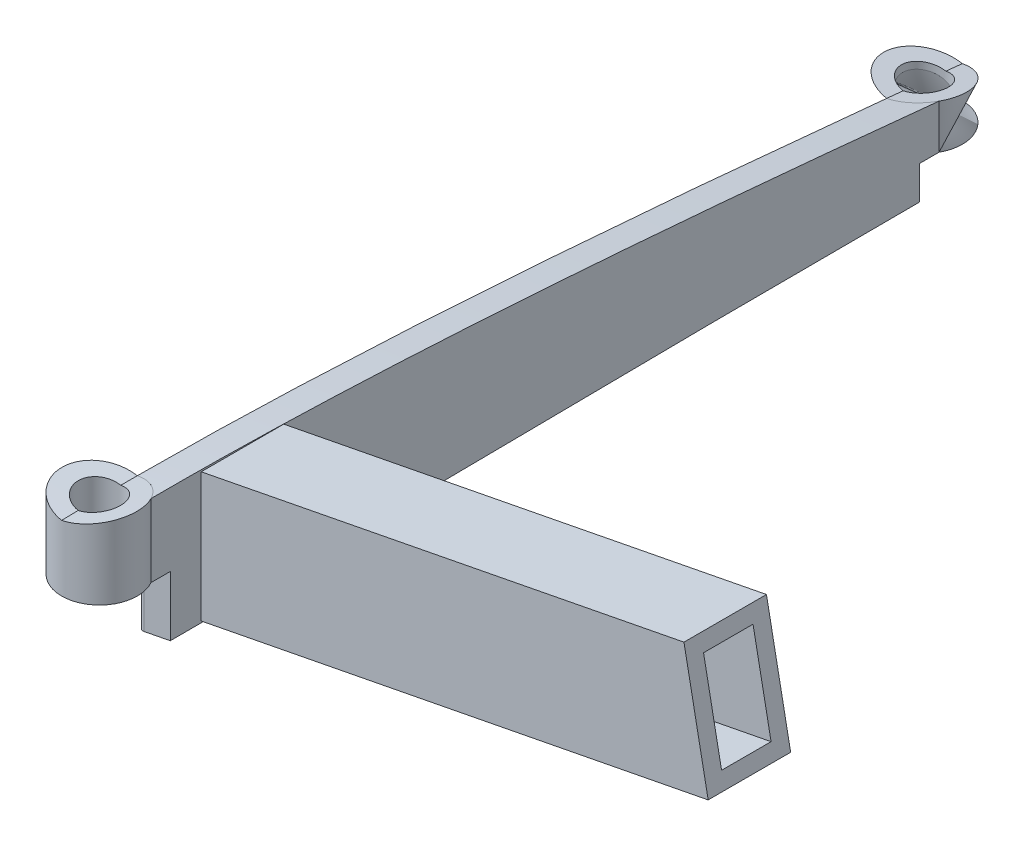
from build123d import *

# Parameters (mm, degrees)
SKETCH16_R              = 2.75
BOSS_EXTRUDE1_DEPTH     = 20
BOSS_EXTRUDE1_2_DEPTH   = 20
SKETCH3_W               = 6
SKETCH3_H               = 9.4
SKETCH22_W              = 3.6
SKETCH22_H              = 7
CUT_EXTRUDE1_DEPTH      = 20
CUT_EXTRUDE1_DEPTH_BACK = 20
SKETCH23_W              = 5.5
SKETCH23_H              = 11.212481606
SKETCH23_H_2            = 9.663247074
SKETCH12_R              = 1.55
CUT_EXTRUDE2_DEPTH      = 20
FILLET1_R               = 0.5
FILLET2_R               = 0.2
CUT_EXTRUDE3_DEPTH      = 60


with BuildPart() as part:
    # Sketch16 → Boss-Extrude1 (new body)
    with BuildSketch(Plane(origin=(0, 0, 0), x_dir=(1, 0, 0), z_dir=(0, 1, 0))):
        with Locations(Location((0, 30, 0), (0, 0, 270))):
            Circle(SKETCH16_R)
    extrude(amount=BOSS_EXTRUDE1_DEPTH)



with BuildPart() as body_2:
    # Sketch16 → Boss-Extrude1 2 (new body)
    with BuildSketch(Plane(origin=(0, 0, 0), x_dir=(1, 0, 0), z_dir=(0, 1, 0))):
        with Locations(Location((0, 90, 0), (0, 0, 270))):
            Circle(SKETCH16_R)
    extrude(amount=BOSS_EXTRUDE1_2_DEPTH)


with BuildPart() as part_1:
    add(part.part)

    add(body_2.part)  # Sweep1 merges body 2
    # Sweep1: sweep along a path in Sketch9
    with BuildLine(Plane.XY) as sweep1_path:
        Line((0, 0), (2.4, 0.466512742))
    # Sketch17 → Sweep1 (sweep)
    with BuildSketch(Plane(origin=(0, 0, 0), x_dir=(0, 0, -1), z_dir=(1, 0, 0))):
        with BuildLine():
            Line((90, 6.760356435), (90, 12.280320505))
            add(Edge.make_bspline(
                [(90, 12.280320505), (89.322155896, 12.349650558), (87.930429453, 12.490997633), (85.82475674, 12.70190774), (83.683002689, 12.91244645), (81.541479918, 13.119724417), (79.400072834, 13.322473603), (77.259038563, 13.521546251), (75.118202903, 13.71555231), (72.977789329, 13.905544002), (70.837583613, 14.089585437), (68.697711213, 14.268870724), (66.558295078, 14.442290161), (64.419368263, 14.60935983), (62.281082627, 14.770505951), (60.143287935, 14.924259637), (58.006121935, 15.07152433), (55.86944987, 15.210192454), (53.733713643, 15.341174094), (51.599238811, 15.463789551), (49.466043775, 15.576226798), (47.334215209, 15.678853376), (45.204084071, 15.770993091), (43.075805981, 15.851304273), (40.949672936, 15.919243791), (38.825903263, 15.973616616), (36.704885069, 16.014103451), (34.587026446, 16.03842993), (32.472760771, 16.046747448), (30.944200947, 16.039504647), (30.120453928, 16.030897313), (30, 16.029537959)],
                knots=[0.209093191, 0.209093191, 0.209093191, 0.209093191, 0.215633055, 0.222519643, 0.22940448, 0.236288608, 0.243169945, 0.250049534, 0.256926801, 0.263801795, 0.270673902, 0.277544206, 0.284412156, 0.291275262, 0.298136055, 0.304993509, 0.311846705, 0.318697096, 0.325544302, 0.332383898, 0.339217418, 0.346046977, 0.352868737, 0.359681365, 0.366488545, 0.373285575, 0.380071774, 0.386849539, 0.393613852, 0.400364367, 0.401520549, 0.401520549, 0.401520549, 0.401520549], degree=3))
            Line((30, 16.029537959), (30, 6.399044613))
            add(Edge.make_bspline(
                [(30, 6.399044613), (30.575800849, 6.393929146), (31.864724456, 6.384443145), (33.867803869, 6.376665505), (36.010156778, 6.374597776), (38.154983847, 6.378750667), (40.302161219, 6.387464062), (42.451856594, 6.401180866), (44.603741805, 6.417679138), (46.757271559, 6.436827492), (48.91196073, 6.458343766), (51.067948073, 6.481493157), (53.225220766, 6.505541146), (55.383600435, 6.530691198), (57.543133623, 6.555928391), (59.703437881, 6.581257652), (61.863787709, 6.605877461), (64.023327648, 6.630503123), (66.182020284, 6.653196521), (68.339878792, 6.675582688), (70.496919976, 6.695584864), (72.652851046, 6.714399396), (74.80809057, 6.730438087), (76.962876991, 6.744146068), (79.117261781, 6.754909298), (81.270817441, 6.76319184), (83.423955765, 6.767815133), (85.576718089, 6.76924054), (87.72899575, 6.76746528), (89.203322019, 6.763311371), (89.960203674, 6.760505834), (90, 6.760356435)],
                knots=[0.600232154, 0.600232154, 0.600232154, 0.600232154, 0.605758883, 0.61260351, 0.619457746, 0.626321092, 0.633189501, 0.640066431, 0.646954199, 0.653843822, 0.660736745, 0.667635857, 0.674538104, 0.681443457, 0.688353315, 0.695266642, 0.702179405, 0.709089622, 0.715995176, 0.722899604, 0.729801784, 0.736699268, 0.743592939, 0.750488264, 0.757381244, 0.764270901, 0.77115816, 0.778047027, 0.784933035, 0.79181564, 0.792197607, 0.792197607, 0.792197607, 0.792197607], degree=3))
        make_face()
    sweep(path=sweep1_path.line)

    # Sweep2: sweep along a path in Sketch20
    with BuildLine(Plane.XY) as sweep2_path:
        Line((0, 0), (39.265087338, 7.632359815))
    # Sketch3 → Sweep2 (sweep)
    with BuildSketch(Plane(origin=(0, 0, 0), x_dir=(0, 0, -1), z_dir=(1, 0, 0))):
        with Locations((38, 11.2)):
            Rectangle(SKETCH3_W, SKETCH3_H)
    sweep(path=sweep2_path.line)

    # Cut-Sweep1: sweep along a path in Sketch20_2
    with BuildLine(Plane.XY) as cut_sweep1_path:
        Line((0, 0), (39.265087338, 7.632359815))
    # Sketch22 → Cut-Sweep1 (sweep, cut)
    with BuildSketch(Plane(origin=(0, 0, 0), x_dir=(0, 0, -1), z_dir=(1, 0, 0))):
        with Locations((38, 11.2)):
            Rectangle(SKETCH22_W, SKETCH22_H)
    sweep(path=cut_sweep1_path.line, mode=Mode.SUBTRACT)

    # Cut-Sweep3: sweep along a path in Sketch20_4
    with BuildLine(Plane.XY) as cut_sweep3_path:
        Line((0, 0), (39.265087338, 7.632359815))
    # Sketch7 → Cut-Sweep3 (sweep, cut)
    with BuildSketch(Plane(origin=(0, 0, 0), x_dir=(0, 0, -1), z_dir=(1, 0, 0))):
        with BuildLine():
            Line((7.930309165, 14.033083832), (7.930309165, 39.45066198))
            Line((7.930309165, 39.45066198), (112.626266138, 39.45066198))
            Line((112.626266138, 39.45066198), (112.626266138, 9.816290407))
            add(Edge.make_bspline(
                [(112.626266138, 9.816290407), (112.262385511, 9.857881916), (111.184218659, 9.980906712), (109.391776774, 10.184510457), (107.248816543, 10.425543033), (105.105999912, 10.66457964), (102.96335039, 10.901772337), (100.820740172, 11.13632573), (98.678093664, 11.368388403), (96.535584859, 11.598060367), (94.393219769, 11.824850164), (92.250930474, 12.048950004), (90.10872475, 12.269844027), (87.966660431, 12.487474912), (85.824920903, 12.701997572), (83.683166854, 12.912536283), (81.541644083, 13.11981425), (79.400236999, 13.322563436), (77.259202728, 13.521636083), (75.118367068, 13.715642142), (72.977953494, 13.905633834), (70.837747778, 14.089675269), (68.697875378, 14.268960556), (66.558459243, 14.442379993), (64.419532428, 14.609449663), (62.281246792, 14.770595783), (60.1434521, 14.92434947), (58.0062861, 15.071614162), (55.869614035, 15.210282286), (53.733877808, 15.341263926), (51.599402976, 15.463879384), (49.466207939, 15.57631663), (47.334379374, 15.678943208), (45.204248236, 15.771082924), (43.075970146, 15.851394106), (40.949837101, 15.919333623), (38.826067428, 15.973706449), (36.705049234, 16.014193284), (34.587190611, 16.038519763), (32.472924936, 16.04683728), (30.362747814, 16.036838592), (28.257449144, 16.006351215), (26.157383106, 15.955356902), (24.063985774, 15.879848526), (21.979039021, 15.779671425), (19.904869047, 15.650534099), (17.844809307, 15.489872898), (15.801771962, 15.293760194), (13.78163961, 15.057819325), (11.790906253, 14.776143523), (9.840809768, 14.443096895), (8.560366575, 14.177851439), (7.930309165, 14.033083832)],
                knots=[0.136276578, 0.136276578, 0.136276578, 0.136276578, 0.139791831, 0.146691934, 0.153591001, 0.160489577, 0.167386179, 0.174281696, 0.181177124, 0.188071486, 0.194963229, 0.201854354, 0.208745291, 0.215633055, 0.222519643, 0.22940448, 0.236288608, 0.243169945, 0.250049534, 0.256926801, 0.263801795, 0.270673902, 0.277544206, 0.284412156, 0.291275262, 0.298136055, 0.304993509, 0.311846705, 0.318697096, 0.325544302, 0.332383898, 0.339217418, 0.346046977, 0.352868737, 0.359681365, 0.366488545, 0.373285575, 0.380071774, 0.386849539, 0.393613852, 0.400364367, 0.407102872, 0.413822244, 0.420526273, 0.427207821, 0.433856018, 0.440471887, 0.447039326, 0.453553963, 0.459991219, 0.466334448, 0.472538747, 0.472538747, 0.472538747, 0.472538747], degree=3))
        make_face()
    sweep(path=cut_sweep3_path.line, mode=Mode.SUBTRACT)

    # Cut-Sweep4: sweep along a path in Sketch8
    with BuildLine(Plane.XY) as cut_sweep4_path:
        Line((0, 0), (-39.265087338, 7.632359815))
    # Sketch7_2 → Cut-Sweep4 (sweep, cut)
    with BuildSketch(Plane(origin=(0, 0, 0), x_dir=(0, 0, -1), z_dir=(1, 0, 0))):
        with BuildLine():
            Line((7.930309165, 14.033083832), (7.930309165, 39.45066198))
            Line((7.930309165, 39.45066198), (112.626266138, 39.45066198))
            Line((112.626266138, 39.45066198), (112.626266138, 9.816290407))
            add(Edge.make_bspline(
                [(112.626266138, 9.816290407), (112.262385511, 9.857881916), (111.184218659, 9.980906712), (109.391776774, 10.184510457), (107.248816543, 10.425543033), (105.105999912, 10.66457964), (102.96335039, 10.901772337), (100.820740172, 11.13632573), (98.678093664, 11.368388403), (96.535584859, 11.598060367), (94.393219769, 11.824850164), (92.250930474, 12.048950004), (90.10872475, 12.269844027), (87.966660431, 12.487474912), (85.824920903, 12.701997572), (83.683166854, 12.912536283), (81.541644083, 13.11981425), (79.400236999, 13.322563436), (77.259202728, 13.521636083), (75.118367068, 13.715642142), (72.977953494, 13.905633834), (70.837747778, 14.089675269), (68.697875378, 14.268960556), (66.558459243, 14.442379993), (64.419532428, 14.609449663), (62.281246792, 14.770595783), (60.1434521, 14.92434947), (58.0062861, 15.071614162), (55.869614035, 15.210282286), (53.733877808, 15.341263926), (51.599402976, 15.463879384), (49.466207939, 15.57631663), (47.334379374, 15.678943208), (45.204248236, 15.771082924), (43.075970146, 15.851394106), (40.949837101, 15.919333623), (38.826067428, 15.973706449), (36.705049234, 16.014193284), (34.587190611, 16.038519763), (32.472924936, 16.04683728), (30.362747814, 16.036838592), (28.257449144, 16.006351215), (26.157383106, 15.955356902), (24.063985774, 15.879848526), (21.979039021, 15.779671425), (19.904869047, 15.650534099), (17.844809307, 15.489872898), (15.801771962, 15.293760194), (13.78163961, 15.057819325), (11.790906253, 14.776143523), (9.840809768, 14.443096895), (8.560366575, 14.177851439), (7.930309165, 14.033083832)],
                knots=[0.136276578, 0.136276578, 0.136276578, 0.136276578, 0.139791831, 0.146691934, 0.153591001, 0.160489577, 0.167386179, 0.174281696, 0.181177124, 0.188071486, 0.194963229, 0.201854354, 0.208745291, 0.215633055, 0.222519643, 0.22940448, 0.236288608, 0.243169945, 0.250049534, 0.256926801, 0.263801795, 0.270673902, 0.277544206, 0.284412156, 0.291275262, 0.298136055, 0.304993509, 0.311846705, 0.318697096, 0.325544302, 0.332383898, 0.339217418, 0.346046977, 0.352868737, 0.359681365, 0.366488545, 0.373285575, 0.380071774, 0.386849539, 0.393613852, 0.400364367, 0.407102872, 0.413822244, 0.420526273, 0.427207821, 0.433856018, 0.440471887, 0.447039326, 0.453553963, 0.459991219, 0.466334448, 0.472538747, 0.472538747, 0.472538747, 0.472538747], degree=3))
        make_face()
    sweep(path=cut_sweep4_path.line, mode=Mode.SUBTRACT)

    # Sketch23 → Cut-Extrude1 (cut, two sides: drawn at the far end of the back side and taken through both)
    with BuildSketch(Plane(origin=(0, 0, 0), x_dir=(0, 0, -1), z_dir=(1, 0, 0)).offset(-CUT_EXTRUDE1_DEPTH_BACK)):
        with Locations((30, 5.606240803)):
            Rectangle(SKETCH23_W, SKETCH23_H)
        with Locations((90, 4.831623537)):
            Rectangle(SKETCH23_W, SKETCH23_H_2)
    extrude(amount=CUT_EXTRUDE1_DEPTH + CUT_EXTRUDE1_DEPTH_BACK, mode=Mode.SUBTRACT)

    # Sketch12 → Cut-Extrude2 (cut)
    with BuildSketch(Plane(origin=(0, 0, 0), x_dir=(1, 0, 0), z_dir=(0, 1, 0))):
        with Locations(Location((0, 30, 0), (0, 0, 90))):
            Circle(SKETCH12_R)
        with Locations(Location((0, 90, 0), (0, 0, 90))):
            Circle(SKETCH12_R)
    extrude(amount=CUT_EXTRUDE2_DEPTH, mode=Mode.SUBTRACT)

    # Fillet1
    fillet1_edges = [part_1.edges().sort_by_distance(p)[0] for p in [
        (0, 8.215382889, -87.25),
        (0, 8.796898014, -32.75),
    ]]
    fillet(fillet1_edges, radius=FILLET1_R)

    # Fillet2
    fillet2_edges = [part_1.edges().sort_by_distance(p)[0] for p in [
        (0, 7.7, -38),
        (0, 11.2, -39.8),
        (0, 14.7, -38),
        (0, 11.2, -36.2),
    ]]
    fillet(fillet2_edges, radius=FILLET2_R)

    # Sketch24 → Cut-Extrude3 (cut)
    with BuildSketch(Plane.XY):
        Polygon((39.265087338, 14.132359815), (36.175991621, 30.02437959), (47.710538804, 30.112880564), (47.852822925, 11.568644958), align=None)
    extrude(amount=-CUT_EXTRUDE3_DEPTH, mode=Mode.SUBTRACT)


solid = part_1.part
